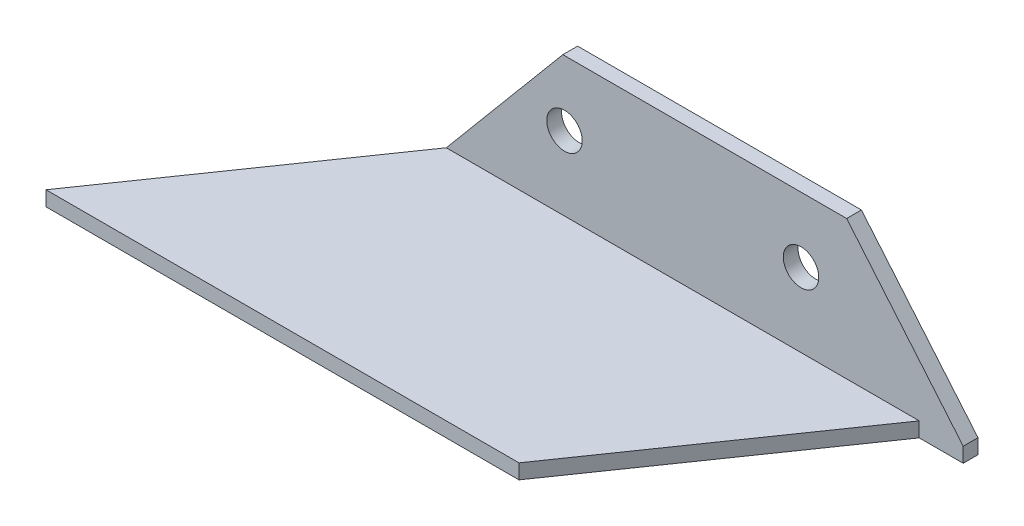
ISO-10303-21;
HEADER;
FILE_DESCRIPTION(('STEP AP214'),'2;1');
FILE_NAME('part.step','',(''),(''),'','','');
FILE_SCHEMA(('AUTOMOTIVE_DESIGN { 1 0 10303 214 1 1 1 1 }'));
ENDSEC;
DATA;
#1=APPLICATION_CONTEXT('core data for automotive mechanical design processes');
#2=APPLICATION_PROTOCOL_DEFINITION('international standard','automotive_design',2000,#1);
#3=PRODUCT_CONTEXT('',#1,'mechanical');
#4=PRODUCT('Part','Part','',(#3));
#5=PRODUCT_RELATED_PRODUCT_CATEGORY('part','',(#4));
#6=PRODUCT_DEFINITION_FORMATION('','',#4);
#7=PRODUCT_DEFINITION_CONTEXT('part definition',#1,'design');
#8=PRODUCT_DEFINITION('design','',#6,#7);
#9=PRODUCT_DEFINITION_SHAPE('','',#8);
#10=(LENGTH_UNIT() NAMED_UNIT(*) SI_UNIT(.MILLI.,.METRE.));
#11=(NAMED_UNIT(*) PLANE_ANGLE_UNIT() SI_UNIT($,.RADIAN.));
#12=(NAMED_UNIT(*) SI_UNIT($,.STERADIAN.) SOLID_ANGLE_UNIT());
#13=UNCERTAINTY_MEASURE_WITH_UNIT(LENGTH_MEASURE(1.E-05),#10,'distance_accuracy_value','');
#14=(GEOMETRIC_REPRESENTATION_CONTEXT(3) GLOBAL_UNCERTAINTY_ASSIGNED_CONTEXT((#13)) GLOBAL_UNIT_ASSIGNED_CONTEXT((#10,
#11,#12)) REPRESENTATION_CONTEXT('',''));
#15=CARTESIAN_POINT('',(0.,0.,0.));
#16=DIRECTION('',(0.,0.,1.));
#17=DIRECTION('',(1.,0.,0.));
#18=AXIS2_PLACEMENT_3D('',#15,#16,#17);
#19=CARTESIAN_POINT('',(0.,3.175,0.));
#20=DIRECTION('',(0.,0.,-1.));
#21=DIRECTION('',(-1.,0.,0.));
#22=AXIS2_PLACEMENT_3D('',#19,#20,#21);
#23=PLANE('',#22);
#24=DIRECTION('',(1.,0.,0.));
#25=VECTOR('',#24,1.);
#26=CARTESIAN_POINT('',(0.,0.,0.));
#27=LINE('',#26,#25);
#28=CARTESIAN_POINT('',(0.,0.,0.));
#29=VERTEX_POINT('',#28);
#30=CARTESIAN_POINT('',(101.6,0.,0.));
#31=VERTEX_POINT('',#30);
#32=EDGE_CURVE('E133',#29,#31,#27,.T.);
#33=ORIENTED_EDGE('',*,*,#32,.T.);
#34=DIRECTION('',(0.,-1.,0.));
#35=VECTOR('',#34,1.);
#36=CARTESIAN_POINT('',(101.6,3.175,0.));
#37=LINE('',#36,#35);
#38=CARTESIAN_POINT('',(101.6,3.175,0.));
#39=VERTEX_POINT('',#38);
#40=EDGE_CURVE('E11',#39,#31,#37,.T.);
#41=ORIENTED_EDGE('',*,*,#40,.F.);
#42=DIRECTION('',(1.,0.,0.));
#43=VECTOR('',#42,1.);
#44=CARTESIAN_POINT('',(0.,3.175,0.));
#45=LINE('',#44,#43);
#46=CARTESIAN_POINT('',(0.,3.175,0.));
#47=VERTEX_POINT('',#46);
#48=EDGE_CURVE('E146',#47,#39,#45,.T.);
#49=ORIENTED_EDGE('',*,*,#48,.F.);
#50=DIRECTION('',(0.,-1.,0.));
#51=VECTOR('',#50,1.);
#52=CARTESIAN_POINT('',(0.,3.175,0.));
#53=LINE('',#52,#51);
#54=EDGE_CURVE('E218',#47,#29,#53,.T.);
#55=ORIENTED_EDGE('',*,*,#54,.T.);
#56=EDGE_LOOP('',(#33,#41,#49,#55));
#57=FACE_BOUND('',#56,.T.);
#58=ADVANCED_FACE('F33',(#57),#23,.F.);
#59=CARTESIAN_POINT('',(136.775587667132,3.175,-50.8));
#60=DIRECTION('',(-0.822144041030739,0.,-0.569279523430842));
#61=DIRECTION('',(-0.569279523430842,0.,0.822144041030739));
#62=AXIS2_PLACEMENT_3D('',#59,#60,#61);
#63=PLANE('',#62);
#64=DIRECTION('',(0.569279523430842,0.,-0.822144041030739));
#65=VECTOR('',#64,1.);
#66=CARTESIAN_POINT('',(136.775587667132,0.,-50.8));
#67=LINE('',#66,#65);
#68=CARTESIAN_POINT('',(136.775587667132,0.,-50.8));
#69=VERTEX_POINT('',#68);
#70=EDGE_CURVE('E136',#31,#69,#67,.T.);
#71=ORIENTED_EDGE('',*,*,#70,.T.);
#72=DIRECTION('',(0.,-1.,0.));
#73=VECTOR('',#72,1.);
#74=CARTESIAN_POINT('',(136.775587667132,3.175,-50.8));
#75=LINE('',#74,#73);
#76=CARTESIAN_POINT('',(136.775587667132,3.175,-50.8));
#77=VERTEX_POINT('',#76);
#78=EDGE_CURVE('E42',#77,#69,#75,.T.);
#79=ORIENTED_EDGE('',*,*,#78,.F.);
#80=DIRECTION('',(0.569279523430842,0.,-0.822144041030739));
#81=VECTOR('',#80,1.);
#82=CARTESIAN_POINT('',(136.775587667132,3.175,-50.8));
#83=LINE('',#82,#81);
#84=EDGE_CURVE('E75',#39,#77,#83,.T.);
#85=ORIENTED_EDGE('',*,*,#84,.F.);
#86=ORIENTED_EDGE('',*,*,#40,.T.);
#87=EDGE_LOOP('',(#71,#79,#85,#86));
#88=FACE_BOUND('',#87,.T.);
#89=ADVANCED_FACE('F209',(#88),#63,.F.);
#90=CARTESIAN_POINT('',(0.,3.175,0.));
#91=DIRECTION('',(0.822144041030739,0.,0.569279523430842));
#92=DIRECTION('',(0.569279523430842,0.,-0.822144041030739));
#93=AXIS2_PLACEMENT_3D('',#90,#91,#92);
#94=PLANE('',#93);
#95=DIRECTION('',(-0.569279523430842,0.,0.822144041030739));
#96=VECTOR('',#95,1.);
#97=CARTESIAN_POINT('',(0.,0.,0.));
#98=LINE('',#97,#96);
#99=CARTESIAN_POINT('',(35.1755876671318,0.,-50.8));
#100=VERTEX_POINT('',#99);
#101=EDGE_CURVE('E68',#100,#29,#98,.T.);
#102=ORIENTED_EDGE('',*,*,#101,.T.);
#103=ORIENTED_EDGE('',*,*,#54,.F.);
#104=DIRECTION('',(-0.569279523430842,0.,0.822144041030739));
#105=VECTOR('',#104,1.);
#106=CARTESIAN_POINT('',(0.,3.175,0.));
#107=LINE('',#106,#105);
#108=CARTESIAN_POINT('',(35.1755876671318,3.175,-50.8));
#109=VERTEX_POINT('',#108);
#110=EDGE_CURVE('E51',#109,#47,#107,.T.);
#111=ORIENTED_EDGE('',*,*,#110,.F.);
#112=DIRECTION('',(0.,-1.,0.));
#113=VECTOR('',#112,1.);
#114=CARTESIAN_POINT('',(35.1755876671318,3.175,-50.8));
#115=LINE('',#114,#113);
#116=EDGE_CURVE('E65',#109,#100,#115,.T.);
#117=ORIENTED_EDGE('',*,*,#116,.T.);
#118=EDGE_LOOP('',(#102,#103,#111,#117));
#119=FACE_BOUND('',#118,.T.);
#120=ADVANCED_FACE('F214',(#119),#94,.F.);
#121=CARTESIAN_POINT('',(0.,3.175,0.));
#122=DIRECTION('',(0.,-1.,0.));
#123=DIRECTION('',(0.,0.,-1.));
#124=AXIS2_PLACEMENT_3D('',#121,#122,#123);
#125=PLANE('',#124);
#126=ORIENTED_EDGE('',*,*,#48,.T.);
#127=ORIENTED_EDGE('',*,*,#84,.T.);
#128=DIRECTION('',(-1.,0.,0.));
#129=VECTOR('',#128,1.);
#130=CARTESIAN_POINT('',(35.1755876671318,3.175,-50.8));
#131=LINE('',#130,#129);
#132=EDGE_CURVE('E339',#77,#109,#131,.T.);
#133=ORIENTED_EDGE('',*,*,#132,.T.);
#134=ORIENTED_EDGE('',*,*,#110,.T.);
#135=EDGE_LOOP('',(#126,#127,#133,#134));
#136=FACE_BOUND('',#135,.T.);
#137=ADVANCED_FACE('F252',(#136),#125,.F.);
#138=CARTESIAN_POINT('',(0.,0.,0.));
#139=DIRECTION('',(0.,-1.,0.));
#140=DIRECTION('',(0.,0.,-1.));
#141=AXIS2_PLACEMENT_3D('',#138,#139,#140);
#142=PLANE('',#141);
#143=ORIENTED_EDGE('',*,*,#32,.F.);
#144=ORIENTED_EDGE('',*,*,#101,.F.);
#145=DIRECTION('',(0.,0.,1.));
#146=VECTOR('',#145,1.);
#147=CARTESIAN_POINT('',(35.1755876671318,0.,-53.975));
#148=LINE('',#147,#146);
#149=CARTESIAN_POINT('',(35.1755876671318,0.,-53.975));
#150=VERTEX_POINT('',#149);
#151=EDGE_CURVE('E152',#150,#100,#148,.T.);
#152=ORIENTED_EDGE('',*,*,#151,.F.);
#153=DIRECTION('',(-1.,0.,0.));
#154=VECTOR('',#153,1.);
#155=CARTESIAN_POINT('',(146.221444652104,0.,-53.975));
#156=LINE('',#155,#154);
#157=CARTESIAN_POINT('',(146.221444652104,0.,-53.975));
#158=VERTEX_POINT('',#157);
#159=EDGE_CURVE('E126',#158,#150,#156,.T.);
#160=ORIENTED_EDGE('',*,*,#159,.F.);
#161=DIRECTION('',(0.,0.,1.));
#162=VECTOR('',#161,1.);
#163=CARTESIAN_POINT('',(146.221444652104,0.,-53.975));
#164=LINE('',#163,#162);
#165=CARTESIAN_POINT('',(146.221444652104,0.,-50.8));
#166=VERTEX_POINT('',#165);
#167=EDGE_CURVE('E154',#158,#166,#164,.T.);
#168=ORIENTED_EDGE('',*,*,#167,.T.);
#169=DIRECTION('',(-1.,0.,0.));
#170=VECTOR('',#169,1.);
#171=CARTESIAN_POINT('',(146.221444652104,0.,-50.8));
#172=LINE('',#171,#170);
#173=EDGE_CURVE('E130',#166,#69,#172,.T.);
#174=ORIENTED_EDGE('',*,*,#173,.T.);
#175=ORIENTED_EDGE('',*,*,#70,.F.);
#176=EDGE_LOOP('',(#143,#144,#152,#160,#168,#174,#175));
#177=FACE_BOUND('',#176,.T.);
#178=ADVANCED_FACE('F220',(#177),#142,.T.);
#179=CARTESIAN_POINT('',(35.1755876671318,0.,-53.975));
#180=DIRECTION('',(1.,0.,0.));
#181=DIRECTION('',(0.,0.,-1.));
#182=AXIS2_PLACEMENT_3D('',#179,#180,#181);
#183=PLANE('',#182);
#184=ORIENTED_EDGE('',*,*,#116,.F.);
#185=DIRECTION('',(0.,0.,1.));
#186=VECTOR('',#185,1.);
#187=CARTESIAN_POINT('',(35.1755876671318,3.175,-53.975));
#188=LINE('',#187,#186);
#189=CARTESIAN_POINT('',(35.1755876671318,3.175,-53.975));
#190=VERTEX_POINT('',#189);
#191=EDGE_CURVE('E115',#190,#109,#188,.T.);
#192=ORIENTED_EDGE('',*,*,#191,.F.);
#193=DIRECTION('',(0.,1.,0.));
#194=VECTOR('',#193,1.);
#195=CARTESIAN_POINT('',(35.1755876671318,0.,-53.975));
#196=LINE('',#195,#194);
#197=EDGE_CURVE('E121',#150,#190,#196,.T.);
#198=ORIENTED_EDGE('',*,*,#197,.F.);
#199=ORIENTED_EDGE('',*,*,#151,.T.);
#200=EDGE_LOOP('',(#184,#192,#198,#199));
#201=FACE_BOUND('',#200,.T.);
#202=ADVANCED_FACE('F132',(#201),#183,.F.);
#203=CARTESIAN_POINT('',(35.1755876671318,3.175,-53.975));
#204=DIRECTION('',(0.766044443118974,-0.642787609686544,0.));
#205=DIRECTION('',(0.642787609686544,0.766044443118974,0.));
#206=AXIS2_PLACEMENT_3D('',#203,#204,#205);
#207=PLANE('',#206);
#208=DIRECTION('',(0.642787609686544,0.766044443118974,0.));
#209=VECTOR('',#208,1.);
#210=CARTESIAN_POINT('',(35.1755876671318,3.175,-50.8));
#211=LINE('',#210,#209);
#212=CARTESIAN_POINT('',(60.2185161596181,33.02,-50.8));
#213=VERTEX_POINT('',#212);
#214=EDGE_CURVE('E177',#109,#213,#211,.T.);
#215=ORIENTED_EDGE('',*,*,#214,.T.);
#216=DIRECTION('',(0.,0.,1.));
#217=VECTOR('',#216,1.);
#218=CARTESIAN_POINT('',(60.2185161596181,33.02,-53.975));
#219=LINE('',#218,#217);
#220=CARTESIAN_POINT('',(60.2185161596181,33.02,-53.975));
#221=VERTEX_POINT('',#220);
#222=EDGE_CURVE('E117',#221,#213,#219,.T.);
#223=ORIENTED_EDGE('',*,*,#222,.F.);
#224=DIRECTION('',(0.642787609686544,0.766044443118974,0.));
#225=VECTOR('',#224,1.);
#226=CARTESIAN_POINT('',(35.1755876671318,3.175,-53.975));
#227=LINE('',#226,#225);
#228=EDGE_CURVE('E111',#190,#221,#227,.T.);
#229=ORIENTED_EDGE('',*,*,#228,.F.);
#230=ORIENTED_EDGE('',*,*,#191,.T.);
#231=EDGE_LOOP('',(#215,#223,#229,#230));
#232=FACE_BOUND('',#231,.T.);
#233=ADVANCED_FACE('F113',(#232),#207,.F.);
#234=CARTESIAN_POINT('',(60.2185161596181,33.02,-53.975));
#235=DIRECTION('',(0.,-1.,0.));
#236=DIRECTION('',(1.,0.,0.));
#237=AXIS2_PLACEMENT_3D('',#234,#235,#236);
#238=PLANE('',#237);
#239=DIRECTION('',(1.,0.,0.));
#240=VECTOR('',#239,1.);
#241=CARTESIAN_POINT('',(60.2185161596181,33.02,-50.8));
#242=LINE('',#241,#240);
#243=CARTESIAN_POINT('',(121.178516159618,33.02,-50.8));
#244=VERTEX_POINT('',#243);
#245=EDGE_CURVE('E175',#213,#244,#242,.T.);
#246=ORIENTED_EDGE('',*,*,#245,.T.);
#247=DIRECTION('',(0.,0.,1.));
#248=VECTOR('',#247,1.);
#249=CARTESIAN_POINT('',(121.178516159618,33.02,-53.975));
#250=LINE('',#249,#248);
#251=CARTESIAN_POINT('',(121.178516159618,33.02,-53.975));
#252=VERTEX_POINT('',#251);
#253=EDGE_CURVE('E138',#252,#244,#250,.T.);
#254=ORIENTED_EDGE('',*,*,#253,.F.);
#255=DIRECTION('',(1.,0.,0.));
#256=VECTOR('',#255,1.);
#257=CARTESIAN_POINT('',(60.2185161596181,33.02,-53.975));
#258=LINE('',#257,#256);
#259=EDGE_CURVE('E120',#221,#252,#258,.T.);
#260=ORIENTED_EDGE('',*,*,#259,.F.);
#261=ORIENTED_EDGE('',*,*,#222,.T.);
#262=EDGE_LOOP('',(#246,#254,#260,#261));
#263=FACE_BOUND('',#262,.T.);
#264=ADVANCED_FACE('F245',(#263),#238,.F.);
#265=CARTESIAN_POINT('',(121.178516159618,33.02,-53.975));
#266=DIRECTION('',(-0.766044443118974,-0.642787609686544,0.));
#267=DIRECTION('',(0.642787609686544,-0.766044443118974,0.));
#268=AXIS2_PLACEMENT_3D('',#265,#266,#267);
#269=PLANE('',#268);
#270=DIRECTION('',(0.642787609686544,-0.766044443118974,0.));
#271=VECTOR('',#270,1.);
#272=CARTESIAN_POINT('',(121.178516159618,33.02,-50.8));
#273=LINE('',#272,#271);
#274=CARTESIAN_POINT('',(146.221444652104,3.175,-50.8));
#275=VERTEX_POINT('',#274);
#276=EDGE_CURVE('E166',#244,#275,#273,.T.);
#277=ORIENTED_EDGE('',*,*,#276,.T.);
#278=DIRECTION('',(0.,0.,1.));
#279=VECTOR('',#278,1.);
#280=CARTESIAN_POINT('',(146.221444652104,3.175,-53.975));
#281=LINE('',#280,#279);
#282=CARTESIAN_POINT('',(146.221444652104,3.175,-53.975));
#283=VERTEX_POINT('',#282);
#284=EDGE_CURVE('E157',#283,#275,#281,.T.);
#285=ORIENTED_EDGE('',*,*,#284,.F.);
#286=DIRECTION('',(0.642787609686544,-0.766044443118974,0.));
#287=VECTOR('',#286,1.);
#288=CARTESIAN_POINT('',(121.178516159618,33.02,-53.975));
#289=LINE('',#288,#287);
#290=EDGE_CURVE('E167',#252,#283,#289,.T.);
#291=ORIENTED_EDGE('',*,*,#290,.F.);
#292=ORIENTED_EDGE('',*,*,#253,.T.);
#293=EDGE_LOOP('',(#277,#285,#291,#292));
#294=FACE_BOUND('',#293,.T.);
#295=ADVANCED_FACE('F164',(#294),#269,.F.);
#296=CARTESIAN_POINT('',(146.221444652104,3.175,-53.975));
#297=DIRECTION('',(-1.,0.,0.));
#298=DIRECTION('',(0.,0.,1.));
#299=AXIS2_PLACEMENT_3D('',#296,#297,#298);
#300=PLANE('',#299);
#301=DIRECTION('',(0.,-1.,0.));
#302=VECTOR('',#301,1.);
#303=CARTESIAN_POINT('',(146.221444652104,3.175,-50.8));
#304=LINE('',#303,#302);
#305=EDGE_CURVE('E145',#275,#166,#304,.T.);
#306=ORIENTED_EDGE('',*,*,#305,.T.);
#307=ORIENTED_EDGE('',*,*,#167,.F.);
#308=DIRECTION('',(0.,-1.,0.));
#309=VECTOR('',#308,1.);
#310=CARTESIAN_POINT('',(146.221444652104,3.175,-53.975));
#311=LINE('',#310,#309);
#312=EDGE_CURVE('E183',#283,#158,#311,.T.);
#313=ORIENTED_EDGE('',*,*,#312,.F.);
#314=ORIENTED_EDGE('',*,*,#284,.T.);
#315=EDGE_LOOP('',(#306,#307,#313,#314));
#316=FACE_BOUND('',#315,.T.);
#317=ADVANCED_FACE('F236',(#316),#300,.F.);
#318=CARTESIAN_POINT('',(0.,0.,-53.975));
#319=DIRECTION('',(0.,0.,-1.));
#320=DIRECTION('',(-1.,0.,0.));
#321=AXIS2_PLACEMENT_3D('',#318,#319,#320);
#322=PLANE('',#321);
#323=CARTESIAN_POINT('',(111.375587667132,19.05,-53.975));
#324=DIRECTION('',(0.,0.,-1.));
#325=DIRECTION('',(-1.,0.,0.));
#326=AXIS2_PLACEMENT_3D('',#323,#324,#325);
#327=CIRCLE('',#326,3.81);
#328=CARTESIAN_POINT('',(107.565587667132,19.05,-53.975));
#329=VERTEX_POINT('',#328);
#330=EDGE_CURVE('E190',#329,#329,#327,.T.);
#331=ORIENTED_EDGE('',*,*,#330,.F.);
#332=EDGE_LOOP('',(#331));
#333=FACE_BOUND('',#332,.T.);
#334=CARTESIAN_POINT('',(60.5755876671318,19.05,-53.975));
#335=DIRECTION('',(0.,0.,-1.));
#336=DIRECTION('',(-1.,0.,0.));
#337=AXIS2_PLACEMENT_3D('',#334,#335,#336);
#338=CIRCLE('',#337,3.81);
#339=CARTESIAN_POINT('',(56.7655876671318,19.05,-53.975));
#340=VERTEX_POINT('',#339);
#341=EDGE_CURVE('E187',#340,#340,#338,.T.);
#342=ORIENTED_EDGE('',*,*,#341,.F.);
#343=EDGE_LOOP('',(#342));
#344=FACE_BOUND('',#343,.T.);
#345=ORIENTED_EDGE('',*,*,#197,.T.);
#346=ORIENTED_EDGE('',*,*,#228,.T.);
#347=ORIENTED_EDGE('',*,*,#259,.T.);
#348=ORIENTED_EDGE('',*,*,#290,.T.);
#349=ORIENTED_EDGE('',*,*,#312,.T.);
#350=ORIENTED_EDGE('',*,*,#159,.T.);
#351=EDGE_LOOP('',(#345,#346,#347,#348,#349,#350));
#352=FACE_BOUND('',#351,.T.);
#353=ADVANCED_FACE('F124',(#333,#344,#352),#322,.T.);
#354=CARTESIAN_POINT('',(0.,0.,-50.8));
#355=DIRECTION('',(0.,0.,-1.));
#356=DIRECTION('',(-1.,0.,0.));
#357=AXIS2_PLACEMENT_3D('',#354,#355,#356);
#358=PLANE('',#357);
#359=CARTESIAN_POINT('',(111.375587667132,19.05,-50.8));
#360=DIRECTION('',(0.,0.,-1.));
#361=DIRECTION('',(-1.,0.,0.));
#362=AXIS2_PLACEMENT_3D('',#359,#360,#361);
#363=CIRCLE('',#362,3.81);
#364=CARTESIAN_POINT('',(107.565587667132,19.05,-50.8));
#365=VERTEX_POINT('',#364);
#366=EDGE_CURVE('E36',#365,#365,#363,.T.);
#367=ORIENTED_EDGE('',*,*,#366,.T.);
#368=EDGE_LOOP('',(#367));
#369=FACE_BOUND('',#368,.T.);
#370=CARTESIAN_POINT('',(60.5755876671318,19.05,-50.8));
#371=DIRECTION('',(0.,0.,-1.));
#372=DIRECTION('',(-1.,0.,0.));
#373=AXIS2_PLACEMENT_3D('',#370,#371,#372);
#374=CIRCLE('',#373,3.81);
#375=CARTESIAN_POINT('',(56.7655876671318,19.05,-50.8));
#376=VERTEX_POINT('',#375);
#377=EDGE_CURVE('E181',#376,#376,#374,.T.);
#378=ORIENTED_EDGE('',*,*,#377,.T.);
#379=EDGE_LOOP('',(#378));
#380=FACE_BOUND('',#379,.T.);
#381=ORIENTED_EDGE('',*,*,#132,.F.);
#382=ORIENTED_EDGE('',*,*,#78,.T.);
#383=ORIENTED_EDGE('',*,*,#173,.F.);
#384=ORIENTED_EDGE('',*,*,#305,.F.);
#385=ORIENTED_EDGE('',*,*,#276,.F.);
#386=ORIENTED_EDGE('',*,*,#245,.F.);
#387=ORIENTED_EDGE('',*,*,#214,.F.);
#388=EDGE_LOOP('',(#381,#382,#383,#384,#385,#386,#387));
#389=FACE_BOUND('',#388,.T.);
#390=ADVANCED_FACE('F173',(#369,#380,#389),#358,.F.);
#391=CARTESIAN_POINT('',(60.5755876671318,19.05,2.50000000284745E-05));
#392=DIRECTION('',(0.,0.,-1.));
#393=DIRECTION('',(-1.,0.,0.));
#394=AXIS2_PLACEMENT_3D('',#391,#392,#393);
#395=CYLINDRICAL_SURFACE('',#394,3.81);
#396=ORIENTED_EDGE('',*,*,#341,.T.);
#397=EDGE_LOOP('',(#396));
#398=FACE_BOUND('',#397,.T.);
#399=ORIENTED_EDGE('',*,*,#377,.F.);
#400=EDGE_LOOP('',(#399));
#401=FACE_BOUND('',#400,.T.);
#402=ADVANCED_FACE('F201',(#398,#401),#395,.F.);
#403=CARTESIAN_POINT('',(111.375587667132,19.05,2.50000000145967E-05));
#404=DIRECTION('',(0.,0.,-1.));
#405=DIRECTION('',(-1.,0.,0.));
#406=AXIS2_PLACEMENT_3D('',#403,#404,#405);
#407=CYLINDRICAL_SURFACE('',#406,3.81);
#408=ORIENTED_EDGE('',*,*,#330,.T.);
#409=EDGE_LOOP('',(#408));
#410=FACE_BOUND('',#409,.T.);
#411=ORIENTED_EDGE('',*,*,#366,.F.);
#412=EDGE_LOOP('',(#411));
#413=FACE_BOUND('',#412,.T.);
#414=ADVANCED_FACE('F199',(#410,#413),#407,.F.);
#415=CLOSED_SHELL('',(#58,#89,#120,#137,#178,#202,#233,#264,#295,#317,#353,#390,#402,#414));
#416=MANIFOLD_SOLID_BREP('B2',#415);
#417=ADVANCED_BREP_SHAPE_REPRESENTATION('',(#18,#416),#14);
#418=SHAPE_DEFINITION_REPRESENTATION(#9,#417);
ENDSEC;
END-ISO-10303-21;
